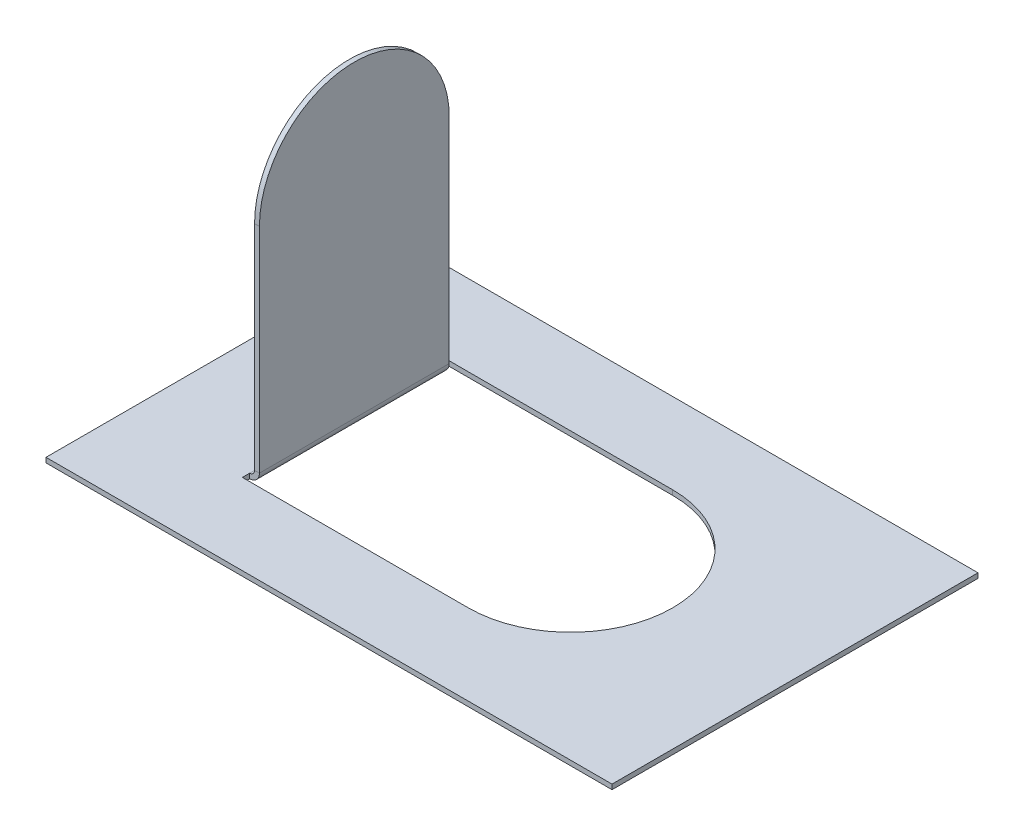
ISO-10303-21;
HEADER;
FILE_DESCRIPTION(('STEP AP214'),'2;1');
FILE_NAME('part.step','',(''),(''),'','','');
FILE_SCHEMA(('AUTOMOTIVE_DESIGN { 1 0 10303 214 1 1 1 1 }'));
ENDSEC;
DATA;
#1=APPLICATION_CONTEXT('core data for automotive mechanical design processes');
#2=APPLICATION_PROTOCOL_DEFINITION('international standard','automotive_design',2000,#1);
#3=PRODUCT_CONTEXT('',#1,'mechanical');
#4=PRODUCT('Part','Part','',(#3));
#5=PRODUCT_RELATED_PRODUCT_CATEGORY('part','',(#4));
#6=PRODUCT_DEFINITION_FORMATION('','',#4);
#7=PRODUCT_DEFINITION_CONTEXT('part definition',#1,'design');
#8=PRODUCT_DEFINITION('design','',#6,#7);
#9=PRODUCT_DEFINITION_SHAPE('','',#8);
#10=(LENGTH_UNIT() NAMED_UNIT(*) SI_UNIT(.MILLI.,.METRE.));
#11=(NAMED_UNIT(*) PLANE_ANGLE_UNIT() SI_UNIT($,.RADIAN.));
#12=(NAMED_UNIT(*) SI_UNIT($,.STERADIAN.) SOLID_ANGLE_UNIT());
#13=UNCERTAINTY_MEASURE_WITH_UNIT(LENGTH_MEASURE(1.E-05),#10,'distance_accuracy_value','');
#14=(GEOMETRIC_REPRESENTATION_CONTEXT(3) GLOBAL_UNCERTAINTY_ASSIGNED_CONTEXT((#13)) GLOBAL_UNIT_ASSIGNED_CONTEXT((#10,
#11,#12)) REPRESENTATION_CONTEXT('',''));
#15=CARTESIAN_POINT('',(0.,0.,0.));
#16=DIRECTION('',(0.,0.,1.));
#17=DIRECTION('',(1.,0.,0.));
#18=AXIS2_PLACEMENT_3D('',#15,#16,#17);
#19=CARTESIAN_POINT('',(47.437909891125,-2.,-110.068885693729));
#20=DIRECTION('',(-1.,0.,0.));
#21=DIRECTION('',(0.,0.,1.));
#22=AXIS2_PLACEMENT_3D('',#19,#20,#21);
#23=PLANE('',#22);
#24=DIRECTION('',(0.,-1.,0.));
#25=VECTOR('',#24,1.);
#26=CARTESIAN_POINT('',(47.437909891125,3.11382863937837E-13,-36.1454440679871));
#27=LINE('',#26,#25);
#28=CARTESIAN_POINT('',(47.437909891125,3.11382863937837E-13,-36.1454440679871));
#29=VERTEX_POINT('',#28);
#30=CARTESIAN_POINT('',(47.437909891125,-1.99999999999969,-36.1454440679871));
#31=VERTEX_POINT('',#30);
#32=EDGE_CURVE('E207',#29,#31,#27,.T.);
#33=ORIENTED_EDGE('',*,*,#32,.F.);
#34=DIRECTION('',(0.,0.,1.));
#35=VECTOR('',#34,1.);
#36=CARTESIAN_POINT('',(47.437909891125,0.,-110.068885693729));
#37=LINE('',#36,#35);
#38=CARTESIAN_POINT('',(47.437909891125,0.,-33.1454440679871));
#39=VERTEX_POINT('',#38);
#40=EDGE_CURVE('E245',#29,#39,#37,.T.);
#41=ORIENTED_EDGE('',*,*,#40,.T.);
#42=DIRECTION('',(0.,1.,0.));
#43=VECTOR('',#42,1.);
#44=CARTESIAN_POINT('',(47.437909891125,-2.,-33.1454440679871));
#45=LINE('',#44,#43);
#46=CARTESIAN_POINT('',(47.437909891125,-2.,-33.1454440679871));
#47=VERTEX_POINT('',#46);
#48=EDGE_CURVE('E276',#47,#39,#45,.T.);
#49=ORIENTED_EDGE('',*,*,#48,.F.);
#50=DIRECTION('',(0.,0.,1.));
#51=VECTOR('',#50,1.);
#52=CARTESIAN_POINT('',(47.437909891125,-2.,-40.1183897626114));
#53=LINE('',#52,#51);
#54=EDGE_CURVE('E247',#31,#47,#53,.T.);
#55=ORIENTED_EDGE('',*,*,#54,.F.);
#56=EDGE_LOOP('',(#33,#41,#49,#55));
#57=FACE_BOUND('',#56,.T.);
#58=ADVANCED_FACE('F53',(#57),#23,.F.);
#59=CARTESIAN_POINT('',(0.,-2.,0.));
#60=DIRECTION('',(-1.,0.,0.));
#61=DIRECTION('',(0.,0.,1.));
#62=AXIS2_PLACEMENT_3D('',#59,#60,#61);
#63=PLANE('',#62);
#64=DIRECTION('',(0.,0.,1.));
#65=VECTOR('',#64,1.);
#66=CARTESIAN_POINT('',(0.,0.,0.));
#67=LINE('',#66,#65);
#68=CARTESIAN_POINT('',(0.,0.,-150.18727545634));
#69=VERTEX_POINT('',#68);
#70=CARTESIAN_POINT('',(0.,0.,0.));
#71=VERTEX_POINT('',#70);
#72=EDGE_CURVE('E271',#69,#71,#67,.T.);
#73=ORIENTED_EDGE('',*,*,#72,.F.);
#74=DIRECTION('',(0.,1.,0.));
#75=VECTOR('',#74,1.);
#76=CARTESIAN_POINT('',(0.,-2.,-150.18727545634));
#77=LINE('',#76,#75);
#78=CARTESIAN_POINT('',(0.,-2.,-150.18727545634));
#79=VERTEX_POINT('',#78);
#80=EDGE_CURVE('E13',#79,#69,#77,.T.);
#81=ORIENTED_EDGE('',*,*,#80,.F.);
#82=DIRECTION('',(0.,0.,1.));
#83=VECTOR('',#82,1.);
#84=CARTESIAN_POINT('',(0.,-2.,0.));
#85=LINE('',#84,#83);
#86=CARTESIAN_POINT('',(0.,-2.,0.));
#87=VERTEX_POINT('',#86);
#88=EDGE_CURVE('E279',#79,#87,#85,.T.);
#89=ORIENTED_EDGE('',*,*,#88,.T.);
#90=DIRECTION('',(0.,1.,0.));
#91=VECTOR('',#90,1.);
#92=CARTESIAN_POINT('',(0.,-2.,0.));
#93=LINE('',#92,#91);
#94=EDGE_CURVE('E292',#87,#71,#93,.T.);
#95=ORIENTED_EDGE('',*,*,#94,.T.);
#96=EDGE_LOOP('',(#73,#81,#89,#95));
#97=FACE_BOUND('',#96,.T.);
#98=ADVANCED_FACE('F55',(#97),#63,.T.);
#99=CARTESIAN_POINT('',(0.,-2.,-150.18727545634));
#100=DIRECTION('',(0.,0.,-1.));
#101=DIRECTION('',(-1.,0.,0.));
#102=AXIS2_PLACEMENT_3D('',#99,#100,#101);
#103=PLANE('',#102);
#104=DIRECTION('',(-1.,0.,0.));
#105=VECTOR('',#104,1.);
#106=CARTESIAN_POINT('',(0.,0.,-150.18727545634));
#107=LINE('',#106,#105);
#108=CARTESIAN_POINT('',(232.274845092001,0.,-150.18727545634));
#109=VERTEX_POINT('',#108);
#110=EDGE_CURVE('E283',#109,#69,#107,.T.);
#111=ORIENTED_EDGE('',*,*,#110,.F.);
#112=DIRECTION('',(0.,1.,0.));
#113=VECTOR('',#112,1.);
#114=CARTESIAN_POINT('',(232.274845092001,-2.,-150.18727545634));
#115=LINE('',#114,#113);
#116=CARTESIAN_POINT('',(232.274845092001,-2.,-150.18727545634));
#117=VERTEX_POINT('',#116);
#118=EDGE_CURVE('E62',#117,#109,#115,.T.);
#119=ORIENTED_EDGE('',*,*,#118,.F.);
#120=DIRECTION('',(-1.,0.,0.));
#121=VECTOR('',#120,1.);
#122=CARTESIAN_POINT('',(0.,-2.,-150.18727545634));
#123=LINE('',#122,#121);
#124=EDGE_CURVE('E289',#117,#79,#123,.T.);
#125=ORIENTED_EDGE('',*,*,#124,.T.);
#126=ORIENTED_EDGE('',*,*,#80,.T.);
#127=EDGE_LOOP('',(#111,#119,#125,#126));
#128=FACE_BOUND('',#127,.T.);
#129=ADVANCED_FACE('F315',(#128),#103,.T.);
#130=CARTESIAN_POINT('',(232.274845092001,-2.,0.));
#131=DIRECTION('',(1.,0.,0.));
#132=DIRECTION('',(0.,0.,-1.));
#133=AXIS2_PLACEMENT_3D('',#130,#131,#132);
#134=PLANE('',#133);
#135=DIRECTION('',(0.,0.,-1.));
#136=VECTOR('',#135,1.);
#137=CARTESIAN_POINT('',(232.274845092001,0.,0.));
#138=LINE('',#137,#136);
#139=CARTESIAN_POINT('',(232.274845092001,0.,0.));
#140=VERTEX_POINT('',#139);
#141=EDGE_CURVE('E298',#140,#109,#138,.T.);
#142=ORIENTED_EDGE('',*,*,#141,.F.);
#143=DIRECTION('',(0.,1.,0.));
#144=VECTOR('',#143,1.);
#145=CARTESIAN_POINT('',(232.274845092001,-2.,0.));
#146=LINE('',#145,#144);
#147=CARTESIAN_POINT('',(232.274845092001,-2.,0.));
#148=VERTEX_POINT('',#147);
#149=EDGE_CURVE('E304',#148,#140,#146,.T.);
#150=ORIENTED_EDGE('',*,*,#149,.F.);
#151=DIRECTION('',(0.,0.,-1.));
#152=VECTOR('',#151,1.);
#153=CARTESIAN_POINT('',(232.274845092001,-2.,0.));
#154=LINE('',#153,#152);
#155=EDGE_CURVE('E286',#148,#117,#154,.T.);
#156=ORIENTED_EDGE('',*,*,#155,.T.);
#157=ORIENTED_EDGE('',*,*,#118,.T.);
#158=EDGE_LOOP('',(#142,#150,#156,#157));
#159=FACE_BOUND('',#158,.T.);
#160=ADVANCED_FACE('F321',(#159),#134,.T.);
#161=CARTESIAN_POINT('',(0.,-2.,0.));
#162=DIRECTION('',(0.,0.,1.));
#163=DIRECTION('',(1.,0.,0.));
#164=AXIS2_PLACEMENT_3D('',#161,#162,#163);
#165=PLANE('',#164);
#166=DIRECTION('',(1.,0.,0.));
#167=VECTOR('',#166,1.);
#168=CARTESIAN_POINT('',(0.,0.,0.));
#169=LINE('',#168,#167);
#170=EDGE_CURVE('E295',#71,#140,#169,.T.);
#171=ORIENTED_EDGE('',*,*,#170,.F.);
#172=ORIENTED_EDGE('',*,*,#94,.F.);
#173=DIRECTION('',(1.,0.,0.));
#174=VECTOR('',#173,1.);
#175=CARTESIAN_POINT('',(0.,-2.,0.));
#176=LINE('',#175,#174);
#177=EDGE_CURVE('E282',#87,#148,#176,.T.);
#178=ORIENTED_EDGE('',*,*,#177,.T.);
#179=ORIENTED_EDGE('',*,*,#149,.T.);
#180=EDGE_LOOP('',(#171,#172,#178,#179));
#181=FACE_BOUND('',#180,.T.);
#182=ADVANCED_FACE('F311',(#181),#165,.T.);
#183=CARTESIAN_POINT('',(0.,-2.,-150.18727545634));
#184=DIRECTION('',(0.,-1.,0.));
#185=DIRECTION('',(0.,0.,-1.));
#186=AXIS2_PLACEMENT_3D('',#183,#184,#185);
#187=PLANE('',#186);
#188=CARTESIAN_POINT('',(47.437909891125,-2.,-117.041831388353));
#189=VERTEX_POINT('',#188);
#190=CARTESIAN_POINT('',(47.437909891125,-2.,-114.041831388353));
#191=VERTEX_POINT('',#190);
#192=EDGE_CURVE('E263',#189,#191,#53,.T.);
#193=ORIENTED_EDGE('',*,*,#192,.T.);
#194=DIRECTION('',(0.,0.,-1.));
#195=VECTOR('',#194,1.);
#196=CARTESIAN_POINT('',(47.437909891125,-1.99999999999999,-114.041831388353));
#197=LINE('',#196,#195);
#198=EDGE_CURVE('E159',#191,#31,#197,.F.);
#199=ORIENTED_EDGE('',*,*,#198,.T.);
#200=ORIENTED_EDGE('',*,*,#54,.T.);
#201=DIRECTION('',(1.,0.,0.));
#202=VECTOR('',#201,1.);
#203=CARTESIAN_POINT('',(47.437909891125,-2.,-33.1454440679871));
#204=LINE('',#203,#202);
#205=CARTESIAN_POINT('',(140.14907563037,-2.,-33.1454440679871));
#206=VERTEX_POINT('',#205);
#207=EDGE_CURVE('E356',#47,#206,#204,.T.);
#208=ORIENTED_EDGE('',*,*,#207,.T.);
#209=CARTESIAN_POINT('',(140.14907563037,-2.,-75.0936377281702));
#210=DIRECTION('',(0.,1.,0.));
#211=DIRECTION('',(0.,0.,-1.));
#212=AXIS2_PLACEMENT_3D('',#209,#210,#211);
#213=CIRCLE('',#212,41.9481936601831);
#214=CARTESIAN_POINT('',(140.14907563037,-2.,-117.041831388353));
#215=VERTEX_POINT('',#214);
#216=EDGE_CURVE('E78',#206,#215,#213,.T.);
#217=ORIENTED_EDGE('',*,*,#216,.T.);
#218=DIRECTION('',(-1.,0.,0.));
#219=VECTOR('',#218,1.);
#220=CARTESIAN_POINT('',(47.437909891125,-2.,-117.041831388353));
#221=LINE('',#220,#219);
#222=EDGE_CURVE('E278',#215,#189,#221,.T.);
#223=ORIENTED_EDGE('',*,*,#222,.T.);
#224=EDGE_LOOP('',(#193,#199,#200,#208,#217,#223));
#225=FACE_BOUND('',#224,.T.);
#226=ORIENTED_EDGE('',*,*,#88,.F.);
#227=ORIENTED_EDGE('',*,*,#124,.F.);
#228=ORIENTED_EDGE('',*,*,#155,.F.);
#229=ORIENTED_EDGE('',*,*,#177,.F.);
#230=EDGE_LOOP('',(#226,#227,#228,#229));
#231=FACE_BOUND('',#230,.T.);
#232=ADVANCED_FACE('F318',(#225,#231),#187,.T.);
#233=CARTESIAN_POINT('',(0.,0.,-150.18727545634));
#234=DIRECTION('',(0.,-1.,0.));
#235=DIRECTION('',(0.,0.,-1.));
#236=AXIS2_PLACEMENT_3D('',#233,#234,#235);
#237=PLANE('',#236);
#238=DIRECTION('',(1.,0.,0.));
#239=VECTOR('',#238,1.);
#240=CARTESIAN_POINT('',(47.437909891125,0.,-33.1454440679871));
#241=LINE('',#240,#239);
#242=CARTESIAN_POINT('',(140.14907563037,0.,-33.1454440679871));
#243=VERTEX_POINT('',#242);
#244=EDGE_CURVE('E210',#39,#243,#241,.T.);
#245=ORIENTED_EDGE('',*,*,#244,.F.);
#246=ORIENTED_EDGE('',*,*,#40,.F.);
#247=DIRECTION('',(0.,0.,-1.));
#248=VECTOR('',#247,1.);
#249=CARTESIAN_POINT('',(47.437909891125,0.,-114.041831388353));
#250=LINE('',#249,#248);
#251=CARTESIAN_POINT('',(47.437909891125,0.,-114.041831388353));
#252=VERTEX_POINT('',#251);
#253=EDGE_CURVE('E216',#252,#29,#250,.F.);
#254=ORIENTED_EDGE('',*,*,#253,.F.);
#255=CARTESIAN_POINT('',(47.437909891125,0.,-117.041831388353));
#256=VERTEX_POINT('',#255);
#257=EDGE_CURVE('E253',#256,#252,#37,.T.);
#258=ORIENTED_EDGE('',*,*,#257,.F.);
#259=DIRECTION('',(-1.,0.,0.));
#260=VECTOR('',#259,1.);
#261=CARTESIAN_POINT('',(47.437909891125,0.,-117.041831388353));
#262=LINE('',#261,#260);
#263=CARTESIAN_POINT('',(140.14907563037,0.,-117.041831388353));
#264=VERTEX_POINT('',#263);
#265=EDGE_CURVE('E254',#264,#256,#262,.T.);
#266=ORIENTED_EDGE('',*,*,#265,.F.);
#267=CARTESIAN_POINT('',(140.14907563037,0.,-75.0936377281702));
#268=DIRECTION('',(0.,1.,0.));
#269=DIRECTION('',(0.,0.,-1.));
#270=AXIS2_PLACEMENT_3D('',#267,#268,#269);
#271=CIRCLE('',#270,41.9481936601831);
#272=EDGE_CURVE('E258',#243,#264,#271,.T.);
#273=ORIENTED_EDGE('',*,*,#272,.F.);
#274=EDGE_LOOP('',(#245,#246,#254,#258,#266,#273));
#275=FACE_BOUND('',#274,.T.);
#276=ORIENTED_EDGE('',*,*,#72,.T.);
#277=ORIENTED_EDGE('',*,*,#170,.T.);
#278=ORIENTED_EDGE('',*,*,#141,.T.);
#279=ORIENTED_EDGE('',*,*,#110,.T.);
#280=EDGE_LOOP('',(#276,#277,#278,#279));
#281=FACE_BOUND('',#280,.T.);
#282=ADVANCED_FACE('F249',(#275,#281),#237,.F.);
#283=ORIENTED_EDGE('',*,*,#257,.T.);
#284=DIRECTION('',(0.,-1.,0.));
#285=VECTOR('',#284,1.);
#286=CARTESIAN_POINT('',(47.437909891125,0.,-114.041831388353));
#287=LINE('',#286,#285);
#288=EDGE_CURVE('E211',#252,#191,#287,.T.);
#289=ORIENTED_EDGE('',*,*,#288,.T.);
#290=ORIENTED_EDGE('',*,*,#192,.F.);
#291=DIRECTION('',(0.,1.,0.));
#292=VECTOR('',#291,1.);
#293=CARTESIAN_POINT('',(47.437909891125,-2.,-117.041831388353));
#294=LINE('',#293,#292);
#295=EDGE_CURVE('E268',#189,#256,#294,.T.);
#296=ORIENTED_EDGE('',*,*,#295,.T.);
#297=EDGE_LOOP('',(#283,#289,#290,#296));
#298=FACE_BOUND('',#297,.T.);
#299=ADVANCED_FACE('F331',(#298),#23,.F.);
#300=CARTESIAN_POINT('',(47.437909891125,-2.,-117.041831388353));
#301=DIRECTION('',(0.,0.,-1.));
#302=DIRECTION('',(-1.,0.,0.));
#303=AXIS2_PLACEMENT_3D('',#300,#301,#302);
#304=PLANE('',#303);
#305=ORIENTED_EDGE('',*,*,#265,.T.);
#306=ORIENTED_EDGE('',*,*,#295,.F.);
#307=ORIENTED_EDGE('',*,*,#222,.F.);
#308=DIRECTION('',(0.,1.,0.));
#309=VECTOR('',#308,1.);
#310=CARTESIAN_POINT('',(140.14907563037,-2.,-117.041831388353));
#311=LINE('',#310,#309);
#312=EDGE_CURVE('E272',#215,#264,#311,.T.);
#313=ORIENTED_EDGE('',*,*,#312,.T.);
#314=EDGE_LOOP('',(#305,#306,#307,#313));
#315=FACE_BOUND('',#314,.T.);
#316=ADVANCED_FACE('F338',(#315),#304,.F.);
#317=CARTESIAN_POINT('',(140.14907563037,-2.,-75.0936377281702));
#318=DIRECTION('',(0.,1.,0.));
#319=DIRECTION('',(0.,0.,1.));
#320=AXIS2_PLACEMENT_3D('',#317,#318,#319);
#321=CYLINDRICAL_SURFACE('',#320,41.9481936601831);
#322=ORIENTED_EDGE('',*,*,#272,.T.);
#323=ORIENTED_EDGE('',*,*,#312,.F.);
#324=ORIENTED_EDGE('',*,*,#216,.F.);
#325=DIRECTION('',(0.,1.,0.));
#326=VECTOR('',#325,1.);
#327=CARTESIAN_POINT('',(140.14907563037,-2.,-33.1454440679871));
#328=LINE('',#327,#326);
#329=EDGE_CURVE('E274',#206,#243,#328,.T.);
#330=ORIENTED_EDGE('',*,*,#329,.T.);
#331=EDGE_LOOP('',(#322,#323,#324,#330));
#332=FACE_BOUND('',#331,.T.);
#333=ADVANCED_FACE('F344',(#332),#321,.F.);
#334=CARTESIAN_POINT('',(47.437909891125,-2.,-33.1454440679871));
#335=DIRECTION('',(0.,0.,1.));
#336=DIRECTION('',(1.,0.,0.));
#337=AXIS2_PLACEMENT_3D('',#334,#335,#336);
#338=PLANE('',#337);
#339=ORIENTED_EDGE('',*,*,#244,.T.);
#340=ORIENTED_EDGE('',*,*,#329,.F.);
#341=ORIENTED_EDGE('',*,*,#207,.F.);
#342=ORIENTED_EDGE('',*,*,#48,.T.);
#343=EDGE_LOOP('',(#339,#340,#341,#342));
#344=FACE_BOUND('',#343,.T.);
#345=ADVANCED_FACE('F362',(#344),#338,.F.);
#346=CARTESIAN_POINT('',(47.437909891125,2.00000000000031,-36.1454440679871));
#347=DIRECTION('',(0.,0.,1.));
#348=DIRECTION('',(0.,-1.,0.));
#349=AXIS2_PLACEMENT_3D('',#346,#347,#348);
#350=PLANE('',#349);
#351=DIRECTION('',(-1.,0.,0.));
#352=VECTOR('',#351,1.);
#353=CARTESIAN_POINT('',(51.437909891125,2.0000000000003,-36.1454440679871));
#354=LINE('',#353,#352);
#355=CARTESIAN_POINT('',(49.437909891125,2.00000000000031,-36.1454440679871));
#356=VERTEX_POINT('',#355);
#357=CARTESIAN_POINT('',(51.437909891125,2.0000000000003,-36.1454440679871));
#358=VERTEX_POINT('',#357);
#359=EDGE_CURVE('E199',#356,#358,#354,.F.);
#360=ORIENTED_EDGE('',*,*,#359,.F.);
#361=CARTESIAN_POINT('',(47.437909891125,2.00000000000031,-36.1454440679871));
#362=DIRECTION('',(0.,0.,-1.));
#363=DIRECTION('',(0.,1.,0.));
#364=AXIS2_PLACEMENT_3D('',#361,#362,#363);
#365=CIRCLE('',#364,2.);
#366=EDGE_CURVE('E161',#29,#356,#365,.F.);
#367=ORIENTED_EDGE('',*,*,#366,.F.);
#368=ORIENTED_EDGE('',*,*,#32,.T.);
#369=CARTESIAN_POINT('',(47.437909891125,2.00000000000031,-36.1454440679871));
#370=DIRECTION('',(0.,0.,-1.));
#371=DIRECTION('',(0.,1.,0.));
#372=AXIS2_PLACEMENT_3D('',#369,#370,#371);
#373=CIRCLE('',#372,4.);
#374=EDGE_CURVE('E218',#31,#358,#373,.F.);
#375=ORIENTED_EDGE('',*,*,#374,.T.);
#376=EDGE_LOOP('',(#360,#367,#368,#375));
#377=FACE_BOUND('',#376,.T.);
#378=ADVANCED_FACE('F241',(#377),#350,.T.);
#379=CARTESIAN_POINT('',(47.437909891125,2.00000000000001,-114.041831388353));
#380=DIRECTION('',(0.,0.,1.));
#381=DIRECTION('',(0.,-1.,0.));
#382=AXIS2_PLACEMENT_3D('',#379,#380,#381);
#383=PLANE('',#382);
#384=CARTESIAN_POINT('',(47.437909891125,2.00000000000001,-114.041831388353));
#385=DIRECTION('',(0.,0.,-1.));
#386=DIRECTION('',(0.,1.,0.));
#387=AXIS2_PLACEMENT_3D('',#384,#385,#386);
#388=CIRCLE('',#387,2.);
#389=CARTESIAN_POINT('',(49.437909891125,2.,-114.041831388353));
#390=VERTEX_POINT('',#389);
#391=EDGE_CURVE('E168',#390,#252,#388,.T.);
#392=ORIENTED_EDGE('',*,*,#391,.F.);
#393=DIRECTION('',(-1.,0.,0.));
#394=VECTOR('',#393,1.);
#395=CARTESIAN_POINT('',(49.437909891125,2.,-114.041831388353));
#396=LINE('',#395,#394);
#397=CARTESIAN_POINT('',(51.437909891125,1.99999999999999,-114.041831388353));
#398=VERTEX_POINT('',#397);
#399=EDGE_CURVE('E165',#390,#398,#396,.F.);
#400=ORIENTED_EDGE('',*,*,#399,.T.);
#401=CARTESIAN_POINT('',(47.437909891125,2.00000000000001,-114.041831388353));
#402=DIRECTION('',(0.,0.,-1.));
#403=DIRECTION('',(0.,1.,0.));
#404=AXIS2_PLACEMENT_3D('',#401,#402,#403);
#405=CIRCLE('',#404,4.);
#406=EDGE_CURVE('E70',#398,#191,#405,.T.);
#407=ORIENTED_EDGE('',*,*,#406,.T.);
#408=ORIENTED_EDGE('',*,*,#288,.F.);
#409=EDGE_LOOP('',(#392,#400,#407,#408));
#410=FACE_BOUND('',#409,.T.);
#411=ADVANCED_FACE('F166',(#410),#383,.F.);
#412=CARTESIAN_POINT('',(47.437909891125,2.00000000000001,-114.041831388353));
#413=DIRECTION('',(0.,0.,-1.));
#414=DIRECTION('',(1.,0.,0.));
#415=AXIS2_PLACEMENT_3D('',#412,#413,#414);
#416=CYLINDRICAL_SURFACE('',#415,4.);
#417=ORIENTED_EDGE('',*,*,#198,.F.);
#418=ORIENTED_EDGE('',*,*,#406,.F.);
#419=DIRECTION('',(0.,0.,-1.));
#420=VECTOR('',#419,1.);
#421=CARTESIAN_POINT('',(51.437909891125,2.00000000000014,-75.0936377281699));
#422=LINE('',#421,#420);
#423=EDGE_CURVE('E156',#358,#398,#422,.T.);
#424=ORIENTED_EDGE('',*,*,#423,.F.);
#425=ORIENTED_EDGE('',*,*,#374,.F.);
#426=EDGE_LOOP('',(#417,#418,#424,#425));
#427=FACE_BOUND('',#426,.T.);
#428=ADVANCED_FACE('F153',(#427),#416,.T.);
#429=CARTESIAN_POINT('',(47.437909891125,2.00000000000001,-114.041831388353));
#430=DIRECTION('',(0.,0.,-1.));
#431=DIRECTION('',(1.,0.,0.));
#432=AXIS2_PLACEMENT_3D('',#429,#430,#431);
#433=CYLINDRICAL_SURFACE('',#432,2.);
#434=ORIENTED_EDGE('',*,*,#253,.T.);
#435=ORIENTED_EDGE('',*,*,#366,.T.);
#436=DIRECTION('',(0.,0.,1.));
#437=VECTOR('',#436,1.);
#438=CARTESIAN_POINT('',(49.437909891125,2.00000000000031,-36.1454440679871));
#439=LINE('',#438,#437);
#440=EDGE_CURVE('E172',#356,#390,#439,.F.);
#441=ORIENTED_EDGE('',*,*,#440,.T.);
#442=ORIENTED_EDGE('',*,*,#391,.T.);
#443=EDGE_LOOP('',(#434,#435,#441,#442));
#444=FACE_BOUND('',#443,.T.);
#445=ADVANCED_FACE('F234',(#444),#433,.F.);
#446=CARTESIAN_POINT('',(51.4379098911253,89.71,-114.041831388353));
#447=DIRECTION('',(0.,0.,1.));
#448=DIRECTION('',(1.,0.,0.));
#449=AXIS2_PLACEMENT_3D('',#446,#447,#448);
#450=PLANE('',#449);
#451=ORIENTED_EDGE('',*,*,#399,.F.);
#452=DIRECTION('',(0.,1.,0.));
#453=VECTOR('',#452,1.);
#454=CARTESIAN_POINT('',(49.4379098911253,89.71,-114.041831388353));
#455=LINE('',#454,#453);
#456=CARTESIAN_POINT('',(49.4379098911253,89.71,-114.041831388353));
#457=VERTEX_POINT('',#456);
#458=EDGE_CURVE('E181',#390,#457,#455,.T.);
#459=ORIENTED_EDGE('',*,*,#458,.T.);
#460=DIRECTION('',(-1.,0.,0.));
#461=VECTOR('',#460,1.);
#462=CARTESIAN_POINT('',(51.4379098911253,89.71,-114.041831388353));
#463=LINE('',#462,#461);
#464=CARTESIAN_POINT('',(51.4379098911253,89.71,-114.041831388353));
#465=VERTEX_POINT('',#464);
#466=EDGE_CURVE('E186',#465,#457,#463,.T.);
#467=ORIENTED_EDGE('',*,*,#466,.F.);
#468=DIRECTION('',(0.,-1.,0.));
#469=VECTOR('',#468,1.);
#470=CARTESIAN_POINT('',(51.4379098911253,89.71,-114.041831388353));
#471=LINE('',#470,#469);
#472=EDGE_CURVE('E177',#398,#465,#471,.F.);
#473=ORIENTED_EDGE('',*,*,#472,.F.);
#474=EDGE_LOOP('',(#451,#459,#467,#473));
#475=FACE_BOUND('',#474,.T.);
#476=ADVANCED_FACE('F184',(#475),#450,.F.);
#477=CARTESIAN_POINT('',(51.437909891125,3.0185610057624E-13,-36.1454440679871));
#478=DIRECTION('',(0.,0.,-1.));
#479=DIRECTION('',(-1.,0.,0.));
#480=AXIS2_PLACEMENT_3D('',#477,#478,#479);
#481=PLANE('',#480);
#482=ORIENTED_EDGE('',*,*,#359,.T.);
#483=DIRECTION('',(0.,1.,0.));
#484=VECTOR('',#483,1.);
#485=CARTESIAN_POINT('',(51.4379098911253,89.71,-36.1454440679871));
#486=LINE('',#485,#484);
#487=CARTESIAN_POINT('',(51.4379098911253,89.71,-36.1454440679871));
#488=VERTEX_POINT('',#487);
#489=EDGE_CURVE('E180',#488,#358,#486,.F.);
#490=ORIENTED_EDGE('',*,*,#489,.F.);
#491=DIRECTION('',(-1.,0.,0.));
#492=VECTOR('',#491,1.);
#493=CARTESIAN_POINT('',(51.4379098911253,89.71,-36.1454440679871));
#494=LINE('',#493,#492);
#495=CARTESIAN_POINT('',(49.4379098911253,89.71,-36.1454440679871));
#496=VERTEX_POINT('',#495);
#497=EDGE_CURVE('E561',#488,#496,#494,.T.);
#498=ORIENTED_EDGE('',*,*,#497,.T.);
#499=DIRECTION('',(0.,-1.,0.));
#500=VECTOR('',#499,1.);
#501=CARTESIAN_POINT('',(49.437909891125,3.08839067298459E-13,-36.1454440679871));
#502=LINE('',#501,#500);
#503=EDGE_CURVE('E188',#496,#356,#502,.T.);
#504=ORIENTED_EDGE('',*,*,#503,.T.);
#505=EDGE_LOOP('',(#482,#490,#498,#504));
#506=FACE_BOUND('',#505,.T.);
#507=ADVANCED_FACE('F432',(#506),#481,.F.);
#508=CARTESIAN_POINT('',(51.4379098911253,89.71,-75.0936377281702));
#509=DIRECTION('',(1.,0.,0.));
#510=DIRECTION('',(0.,1.,0.));
#511=AXIS2_PLACEMENT_3D('',#508,#509,#510);
#512=PLANE('',#511);
#513=ORIENTED_EDGE('',*,*,#489,.T.);
#514=ORIENTED_EDGE('',*,*,#423,.T.);
#515=ORIENTED_EDGE('',*,*,#472,.T.);
#516=CARTESIAN_POINT('',(51.4379098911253,89.71,-75.0936377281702));
#517=DIRECTION('',(1.,0.,0.));
#518=DIRECTION('',(0.,1.,0.));
#519=AXIS2_PLACEMENT_3D('',#516,#517,#518);
#520=CIRCLE('',#519,38.9481936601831);
#521=EDGE_CURVE('E187',#465,#488,#520,.T.);
#522=ORIENTED_EDGE('',*,*,#521,.T.);
#523=EDGE_LOOP('',(#513,#514,#515,#522));
#524=FACE_BOUND('',#523,.T.);
#525=ADVANCED_FACE('F176',(#524),#512,.T.);
#526=CARTESIAN_POINT('',(49.4379098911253,89.71,-75.0936377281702));
#527=DIRECTION('',(1.,0.,0.));
#528=DIRECTION('',(0.,1.,0.));
#529=AXIS2_PLACEMENT_3D('',#526,#527,#528);
#530=PLANE('',#529);
#531=ORIENTED_EDGE('',*,*,#440,.F.);
#532=ORIENTED_EDGE('',*,*,#503,.F.);
#533=CARTESIAN_POINT('',(49.4379098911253,89.71,-75.0936377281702));
#534=DIRECTION('',(1.,0.,0.));
#535=DIRECTION('',(0.,1.,0.));
#536=AXIS2_PLACEMENT_3D('',#533,#534,#535);
#537=CIRCLE('',#536,38.9481936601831);
#538=EDGE_CURVE('E192',#457,#496,#537,.T.);
#539=ORIENTED_EDGE('',*,*,#538,.F.);
#540=ORIENTED_EDGE('',*,*,#458,.F.);
#541=EDGE_LOOP('',(#531,#532,#539,#540));
#542=FACE_BOUND('',#541,.T.);
#543=ADVANCED_FACE('F452',(#542),#530,.F.);
#544=CARTESIAN_POINT('',(51.4379098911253,89.71,-75.0936377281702));
#545=DIRECTION('',(-1.,0.,0.));
#546=DIRECTION('',(0.,-1.,0.));
#547=AXIS2_PLACEMENT_3D('',#544,#545,#546);
#548=CYLINDRICAL_SURFACE('',#547,38.9481936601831);
#549=ORIENTED_EDGE('',*,*,#538,.T.);
#550=ORIENTED_EDGE('',*,*,#497,.F.);
#551=ORIENTED_EDGE('',*,*,#521,.F.);
#552=ORIENTED_EDGE('',*,*,#466,.T.);
#553=EDGE_LOOP('',(#549,#550,#551,#552));
#554=FACE_BOUND('',#553,.T.);
#555=ADVANCED_FACE('F462',(#554),#548,.T.);
#556=CLOSED_SHELL('',(#58,#98,#129,#160,#182,#232,#282,#299,#316,#333,#345,#378,#411,#428,#445,
#476,#507,#525,#543,#555));
#557=MANIFOLD_SOLID_BREP('B2',#556);
#558=ADVANCED_BREP_SHAPE_REPRESENTATION('',(#18,#557),#14);
#559=SHAPE_DEFINITION_REPRESENTATION(#9,#558);
ENDSEC;
END-ISO-10303-21;
